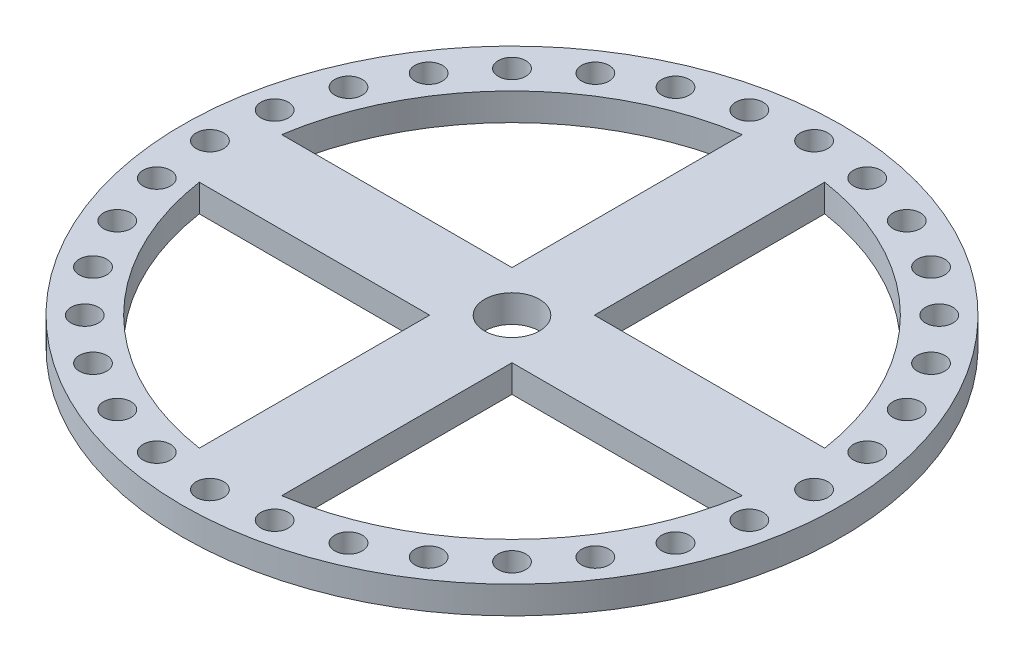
from build123d import *

# Parameters (mm, degrees)
SKETCH3_R           = 60
SKETCH3_R_2         = 5
SKETCH3_R_3         = 2.5
BOSS_EXTRUDE3_DEPTH = 5


with BuildPart() as part:
    # Sketch3 → Boss-Extrude3 (new body)
    with BuildSketch(Plane(origin=(0, 0, 0), x_dir=(1, 0, 0), z_dir=(0, 1, 0))):
        with Locations(Location((0, 0, 0), (0, 0, 270))):
            Circle(SKETCH3_R)
        with BuildLine():
            Line((-7.5, -7.5), (-7.5, -49.434299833))
            ThreePointArc((-7.5, -49.434299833), (-35.355339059, -35.355339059), (-49.434299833, -7.5))
            Line((-49.434299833, -7.5), (-7.5, -7.5))
        make_face(mode=Mode.SUBTRACT)
        with BuildLine():
            Line((7.5, -49.434299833), (7.5, -7.5))
            Line((7.5, -7.5), (49.434299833, -7.5))
            ThreePointArc((49.434299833, -7.5), (35.355339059, -35.355339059), (7.5, -49.434299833))
        make_face(mode=Mode.SUBTRACT)
        with BuildLine():
            Line((49.434299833, 7.5), (7.5, 7.5))
            Line((7.5, 7.5), (7.5, 49.434299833))
            ThreePointArc((7.5, 49.434299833), (35.355339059, 35.355339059), (49.434299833, 7.5))
        make_face(mode=Mode.SUBTRACT)
        with BuildLine():
            Line((-7.5, 49.434299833), (-7.5, 7.5))
            Line((-7.5, 7.5), (-49.434299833, 7.5))
            ThreePointArc((-49.434299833, 7.5), (-35.355339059, 35.355339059), (-7.5, 49.434299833))
        make_face(mode=Mode.SUBTRACT)
        with Locations(Location((0, 0, 0), (0, 0, 270))):
            Circle(SKETCH3_R_2, mode=Mode.SUBTRACT)
        with Locations(Location((-30.556362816, -45.730828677, 0), (0, 0, 270))):
            Circle(SKETCH3_R_3, mode=Mode.SUBTRACT)
        with Locations(Location((-45.730828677, -30.556362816, 0), (0, 0, 270))):
            Circle(SKETCH3_R_3, mode=Mode.SUBTRACT)
        with Locations(Location((-38.890872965, -38.890872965, 0), (0, 0, 270))):
            Circle(SKETCH3_R_3, mode=Mode.SUBTRACT)
        with Locations(Location((-21.04758878, -50.813374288, 0), (0, 0, 270))):
            Circle(SKETCH3_R_3, mode=Mode.SUBTRACT)
        with Locations(Location((-10.729967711, -53.943190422, 0), (0, 0, 270))):
            Circle(SKETCH3_R_3, mode=Mode.SUBTRACT)
        with Locations(Location((-50.813374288, -21.04758878, 0), (0, 0, 270))):
            Circle(SKETCH3_R_3, mode=Mode.SUBTRACT)
        with Locations(Location((-53.943190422, -10.729967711, 0), (0, 0, 270))):
            Circle(SKETCH3_R_3, mode=Mode.SUBTRACT)
        with Locations(Location((-55, 0, 0), (0, 0, 270))):
            Circle(SKETCH3_R_3, mode=Mode.SUBTRACT)
        with Locations(Location((0, -55, 0), (0, 0, 270))):
            Circle(SKETCH3_R_3, mode=Mode.SUBTRACT)
        with Locations(Location((10.729967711, -53.943190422, 0), (0, 0, 270))):
            Circle(SKETCH3_R_3, mode=Mode.SUBTRACT)
        with Locations(Location((21.04758878, -50.813374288, 0), (0, 0, 270))):
            Circle(SKETCH3_R_3, mode=Mode.SUBTRACT)
        with Locations(Location((30.556362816, -45.730828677, 0), (0, 0, 270))):
            Circle(SKETCH3_R_3, mode=Mode.SUBTRACT)
        with Locations(Location((38.890872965, -38.890872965, 0), (0, 0, 270))):
            Circle(SKETCH3_R_3, mode=Mode.SUBTRACT)
        with Locations(Location((45.730828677, -30.556362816, 0), (0, 0, 270))):
            Circle(SKETCH3_R_3, mode=Mode.SUBTRACT)
        with Locations(Location((50.813374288, -21.04758878, 0), (0, 0, 270))):
            Circle(SKETCH3_R_3, mode=Mode.SUBTRACT)
        with Locations(Location((53.943190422, -10.729967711, 0), (0, 0, 270))):
            Circle(SKETCH3_R_3, mode=Mode.SUBTRACT)
        with Locations(Location((-53.943190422, 10.729967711, 0), (0, 0, 270))):
            Circle(SKETCH3_R_3, mode=Mode.SUBTRACT)
        with Locations(Location((-50.813374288, 21.04758878, 0), (0, 0, 270))):
            Circle(SKETCH3_R_3, mode=Mode.SUBTRACT)
        with Locations(Location((-45.730828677, 30.556362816, 0), (0, 0, 270))):
            Circle(SKETCH3_R_3, mode=Mode.SUBTRACT)
        with Locations(Location((-38.890872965, 38.890872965, 0), (0, 0, 270))):
            Circle(SKETCH3_R_3, mode=Mode.SUBTRACT)
        with Locations(Location((-30.556362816, 45.730828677, 0), (0, 0, 270))):
            Circle(SKETCH3_R_3, mode=Mode.SUBTRACT)
        with Locations(Location((-21.04758878, 50.813374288, 0), (0, 0, 270))):
            Circle(SKETCH3_R_3, mode=Mode.SUBTRACT)
        with Locations(Location((-10.729967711, 53.943190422, 0), (0, 0, 270))):
            Circle(SKETCH3_R_3, mode=Mode.SUBTRACT)
        with Locations(Location((30.556362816, 45.730828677, 0), (0, 0, 270))):
            Circle(SKETCH3_R_3, mode=Mode.SUBTRACT)
        with Locations(Location((45.730828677, 30.556362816, 0), (0, 0, 270))):
            Circle(SKETCH3_R_3, mode=Mode.SUBTRACT)
        with Locations(Location((38.890872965, 38.890872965, 0), (0, 0, 270))):
            Circle(SKETCH3_R_3, mode=Mode.SUBTRACT)
        with Locations(Location((21.04758878, 50.813374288, 0), (0, 0, 270))):
            Circle(SKETCH3_R_3, mode=Mode.SUBTRACT)
        with Locations(Location((10.729967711, 53.943190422, 0), (0, 0, 270))):
            Circle(SKETCH3_R_3, mode=Mode.SUBTRACT)
        with Locations(Location((55, 0, 0), (0, 0, 270))):
            Circle(SKETCH3_R_3, mode=Mode.SUBTRACT)
        with Locations(Location((53.943190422, 10.729967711, 0), (0, 0, 270))):
            Circle(SKETCH3_R_3, mode=Mode.SUBTRACT)
        with Locations(Location((50.813374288, 21.04758878, 0), (0, 0, 270))):
            Circle(SKETCH3_R_3, mode=Mode.SUBTRACT)
        with Locations(Location((0, 55, 0), (0, 0, 270))):
            Circle(SKETCH3_R_3, mode=Mode.SUBTRACT)
    extrude(amount=BOSS_EXTRUDE3_DEPTH)


solid = part.part
